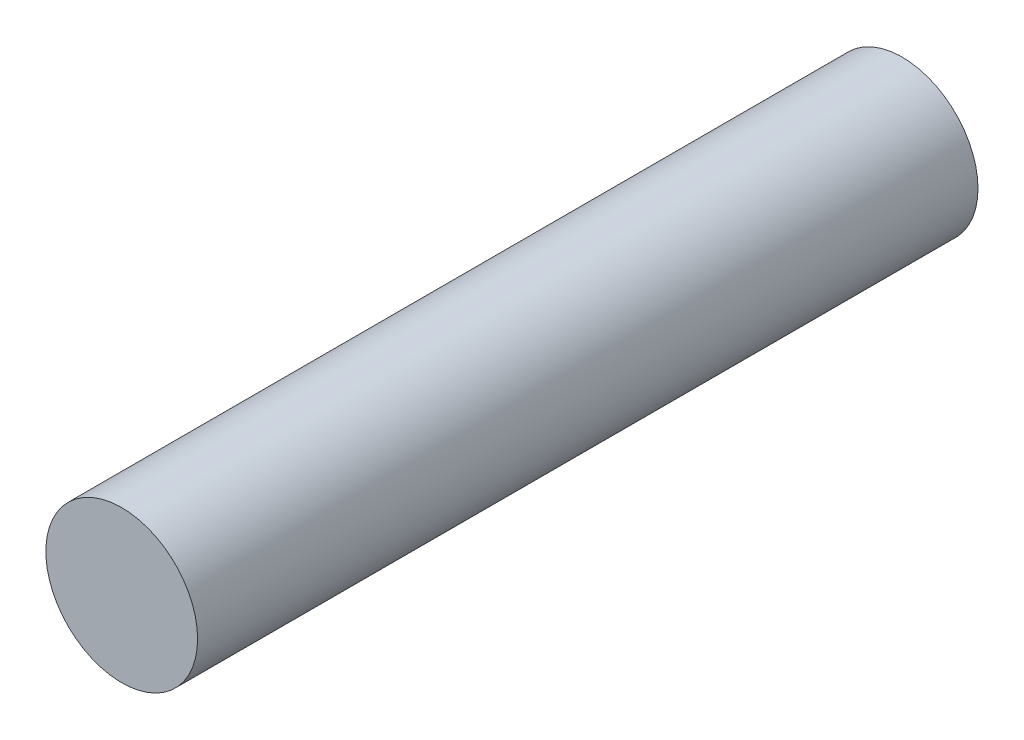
ISO-10303-21;
HEADER;
FILE_DESCRIPTION(('STEP AP214'),'2;1');
FILE_NAME('part.step','',(''),(''),'','','');
FILE_SCHEMA(('AUTOMOTIVE_DESIGN { 1 0 10303 214 1 1 1 1 }'));
ENDSEC;
DATA;
#1=APPLICATION_CONTEXT('core data for automotive mechanical design processes');
#2=APPLICATION_PROTOCOL_DEFINITION('international standard','automotive_design',2000,#1);
#3=PRODUCT_CONTEXT('',#1,'mechanical');
#4=PRODUCT('Part','Part','',(#3));
#5=PRODUCT_RELATED_PRODUCT_CATEGORY('part','',(#4));
#6=PRODUCT_DEFINITION_FORMATION('','',#4);
#7=PRODUCT_DEFINITION_CONTEXT('part definition',#1,'design');
#8=PRODUCT_DEFINITION('design','',#6,#7);
#9=PRODUCT_DEFINITION_SHAPE('','',#8);
#10=(LENGTH_UNIT() NAMED_UNIT(*) SI_UNIT(.MILLI.,.METRE.));
#11=(NAMED_UNIT(*) PLANE_ANGLE_UNIT() SI_UNIT($,.RADIAN.));
#12=(NAMED_UNIT(*) SI_UNIT($,.STERADIAN.) SOLID_ANGLE_UNIT());
#13=UNCERTAINTY_MEASURE_WITH_UNIT(LENGTH_MEASURE(1.E-05),#10,'distance_accuracy_value','');
#14=(GEOMETRIC_REPRESENTATION_CONTEXT(3) GLOBAL_UNCERTAINTY_ASSIGNED_CONTEXT((#13)) GLOBAL_UNIT_ASSIGNED_CONTEXT((#10,
#11,#12)) REPRESENTATION_CONTEXT('',''));
#15=CARTESIAN_POINT('',(0.,0.,0.));
#16=DIRECTION('',(0.,0.,1.));
#17=DIRECTION('',(1.,0.,0.));
#18=AXIS2_PLACEMENT_3D('',#15,#16,#17);
#19=CARTESIAN_POINT('',(0.,0.,0.));
#20=DIRECTION('',(0.,0.,0.999999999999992));
#21=DIRECTION('',(0.999999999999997,0.,0.));
#22=AXIS2_PLACEMENT_3D('',#19,#20,#21);
#23=PLANE('',#22);
#24=CARTESIAN_POINT('',(0.,0.,0.));
#25=DIRECTION('',(0.,0.,0.999999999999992));
#26=DIRECTION('',(0.999999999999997,0.,0.));
#27=AXIS2_PLACEMENT_3D('',#24,#25,#26);
#28=CIRCLE('',#27,1.58496);
#29=CARTESIAN_POINT('',(1.58496000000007,0.,0.));
#30=VERTEX_POINT('',#29);
#31=EDGE_CURVE('E10',#30,#30,#28,.T.);
#32=ORIENTED_EDGE('',*,*,#31,.T.);
#33=EDGE_LOOP('',(#32));
#34=FACE_BOUND('',#33,.T.);
#35=ADVANCED_FACE('F28',(#34),#23,.T.);
#36=CARTESIAN_POINT('',(0.,0.,0.));
#37=DIRECTION('',(0.,0.,0.999999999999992));
#38=DIRECTION('',(0.999999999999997,0.,0.));
#39=AXIS2_PLACEMENT_3D('',#36,#37,#38);
#40=CYLINDRICAL_SURFACE('',#39,1.58496);
#41=CARTESIAN_POINT('',(0.,1.2490009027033E-13,-16.3048904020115));
#42=DIRECTION('',(0.,0.,0.999999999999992));
#43=DIRECTION('',(0.999999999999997,0.,0.));
#44=AXIS2_PLACEMENT_3D('',#41,#42,#43);
#45=CIRCLE('',#44,1.58496);
#46=CARTESIAN_POINT('',(1.58496000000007,0.,-16.3048904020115));
#47=VERTEX_POINT('',#46);
#48=EDGE_CURVE('E34',#47,#47,#45,.T.);
#49=CARTESIAN_POINT('',(1.58496000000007,0.,-16.3048904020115));
#50=CARTESIAN_POINT('',(1.58496000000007,0.,-16.1350477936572));
#51=CARTESIAN_POINT('',(1.58496000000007,0.,-15.9652051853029));
#52=CARTESIAN_POINT('',(1.58496000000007,0.,-15.6255199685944));
#53=CARTESIAN_POINT('',(1.58496000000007,0.,-15.4556773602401));
#54=CARTESIAN_POINT('',(1.58496000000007,0.,-15.1159921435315));
#55=CARTESIAN_POINT('',(1.58496000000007,0.,-14.9461495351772));
#56=CARTESIAN_POINT('',(1.58496000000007,0.,-14.6064643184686));
#57=CARTESIAN_POINT('',(1.58496000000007,0.,-14.4366217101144));
#58=CARTESIAN_POINT('',(1.58496000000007,0.,-14.0969364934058));
#59=CARTESIAN_POINT('',(1.58496000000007,0.,-13.9270938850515));
#60=CARTESIAN_POINT('',(1.58496000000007,0.,-13.5874086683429));
#61=CARTESIAN_POINT('',(1.58496000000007,0.,-13.4175660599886));
#62=CARTESIAN_POINT('',(1.58496000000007,0.,-13.0778808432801));
#63=CARTESIAN_POINT('',(1.58496000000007,0.,-12.9080382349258));
#64=CARTESIAN_POINT('',(1.58496000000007,0.,-12.5683530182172));
#65=CARTESIAN_POINT('',(1.58496000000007,0.,-12.3985104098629));
#66=CARTESIAN_POINT('',(1.58496000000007,0.,-12.0588251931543));
#67=CARTESIAN_POINT('',(1.58496000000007,0.,-11.8889825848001));
#68=CARTESIAN_POINT('',(1.58496000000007,0.,-11.5492973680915));
#69=CARTESIAN_POINT('',(1.58496000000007,0.,-11.3794547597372));
#70=CARTESIAN_POINT('',(1.58496000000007,0.,-11.0397695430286));
#71=CARTESIAN_POINT('',(1.58496000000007,0.,-10.8699269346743));
#72=CARTESIAN_POINT('',(1.58496000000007,0.,-10.5302417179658));
#73=CARTESIAN_POINT('',(1.58496000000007,0.,-10.3603991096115));
#74=CARTESIAN_POINT('',(1.58496000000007,0.,-10.0207138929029));
#75=CARTESIAN_POINT('',(1.58496000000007,0.,-9.85087128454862));
#76=CARTESIAN_POINT('',(1.58496000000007,0.,-9.51118606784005));
#77=CARTESIAN_POINT('',(1.58496000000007,0.,-9.34134345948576));
#78=CARTESIAN_POINT('',(1.58496000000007,0.,-9.00165824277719));
#79=CARTESIAN_POINT('',(1.58496000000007,0.,-8.8318156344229));
#80=CARTESIAN_POINT('',(1.58496000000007,0.,-8.49213041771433));
#81=CARTESIAN_POINT('',(1.58496000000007,0.,-8.32228780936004));
#82=CARTESIAN_POINT('',(1.58496000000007,0.,-7.98260259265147));
#83=CARTESIAN_POINT('',(1.58496000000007,0.,-7.81275998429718));
#84=CARTESIAN_POINT('',(1.58496000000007,0.,-7.47307476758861));
#85=CARTESIAN_POINT('',(1.58496000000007,0.,-7.30323215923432));
#86=CARTESIAN_POINT('',(1.58496000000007,0.,-6.96354694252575));
#87=CARTESIAN_POINT('',(1.58496000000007,0.,-6.79370433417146));
#88=CARTESIAN_POINT('',(1.58496000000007,0.,-6.45401911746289));
#89=CARTESIAN_POINT('',(1.58496000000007,0.,-6.28417650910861));
#90=CARTESIAN_POINT('',(1.58496000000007,0.,-5.94449129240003));
#91=CARTESIAN_POINT('',(1.58496000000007,0.,-5.77464868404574));
#92=CARTESIAN_POINT('',(1.58496000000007,0.,-5.43496346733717));
#93=CARTESIAN_POINT('',(1.58496000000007,0.,-5.26512085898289));
#94=CARTESIAN_POINT('',(1.58496000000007,0.,-4.92543564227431));
#95=CARTESIAN_POINT('',(1.58496000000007,0.,-4.75559303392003));
#96=CARTESIAN_POINT('',(1.58496000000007,0.,-4.41590781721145));
#97=CARTESIAN_POINT('',(1.58496000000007,0.,-4.24606520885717));
#98=CARTESIAN_POINT('',(1.58496000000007,0.,-3.90637999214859));
#99=CARTESIAN_POINT('',(1.58496000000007,0.,-3.73653738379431));
#100=CARTESIAN_POINT('',(1.58496000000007,0.,-3.39685216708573));
#101=CARTESIAN_POINT('',(1.58496000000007,0.,-3.22700955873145));
#102=CARTESIAN_POINT('',(1.58496000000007,0.,-2.88732434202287));
#103=CARTESIAN_POINT('',(1.58496000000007,0.,-2.71748173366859));
#104=CARTESIAN_POINT('',(1.58496000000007,0.,-2.37779651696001));
#105=CARTESIAN_POINT('',(1.58496000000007,0.,-2.20795390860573));
#106=CARTESIAN_POINT('',(1.58496000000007,0.,-1.86826869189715));
#107=CARTESIAN_POINT('',(1.58496000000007,0.,-1.69842608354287));
#108=CARTESIAN_POINT('',(1.58496000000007,0.,-1.35874086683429));
#109=CARTESIAN_POINT('',(1.58496000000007,0.,-1.18889825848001));
#110=CARTESIAN_POINT('',(1.58496000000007,0.,-0.849213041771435));
#111=CARTESIAN_POINT('',(1.58496000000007,0.,-0.679370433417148));
#112=CARTESIAN_POINT('',(1.58496000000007,0.,-0.339685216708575));
#113=CARTESIAN_POINT('',(1.58496000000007,0.,-0.169842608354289));
#114=CARTESIAN_POINT('',(1.58496000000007,0.,0.));
#115=B_SPLINE_CURVE_WITH_KNOTS('',3,(#49,#50,#51,#52,#53,#54,#55,#56,#57,#58,#59,#60,#61,#62,
#63,#64,#65,#66,#67,#68,#69,#70,#71,#72,#73,#74,#75,#76,#77,#78,#79,#80,#81,#82,#83,#84,#85,#86,
#87,#88,#89,#90,#91,#92,#93,#94,#95,#96,#97,#98,#99,#100,#101,#102,#103,#104,#105,#106,#107,
#108,#109,#110,#111,#112,#113,#114),.UNSPECIFIED.,.F.,.F.,(4,2,2,2,2,2,2,2,2,2,2,2,2,2,2,2,2,2,
2,2,2,2,2,2,2,2,2,2,2,2,2,2,4),(0.,0.509527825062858,1.01905565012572,1.52858347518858,
2.03811130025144,2.5476391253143,3.05716695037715,3.56669477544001,4.07622260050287,
4.58575042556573,5.0952782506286,5.60480607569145,6.11433390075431,6.62386172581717,
7.13338955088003,7.64291737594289,8.15244520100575,8.66197302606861,9.17150085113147,
9.68102867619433,10.1905565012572,10.7000843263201,11.2096121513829,11.7191399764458,
12.2286678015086,12.7381956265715,13.2477234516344,13.7572512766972,14.2667791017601,
14.7763069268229,15.2858347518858,15.7953625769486,16.3048904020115),.UNSPECIFIED.);
#116=EDGE_CURVE('BSEAM54',#47,#30,#115,.T.);
#117=ORIENTED_EDGE('',*,*,#48,.T.);
#118=ORIENTED_EDGE('',*,*,#31,.F.);
#119=ORIENTED_EDGE('',*,*,#116,.T.);
#120=ORIENTED_EDGE('',*,*,#116,.F.);
#121=EDGE_LOOP('',(#117,#119,#118,#120));
#122=FACE_BOUND('',#121,.T.);
#123=ADVANCED_FACE('F54',(#122),#40,.T.);
#124=CARTESIAN_POINT('',(0.,1.2490009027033E-13,-16.3048904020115));
#125=DIRECTION('',(0.,0.,0.999999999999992));
#126=DIRECTION('',(0.999999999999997,0.,0.));
#127=AXIS2_PLACEMENT_3D('',#124,#125,#126);
#128=CONICAL_SURFACE('',#127,1.58496,1.36135681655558);
#129=CARTESIAN_POINT('',(0.,1.2490009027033E-13,-16.5607999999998));
#130=DIRECTION('',(0.,0.,0.999999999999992));
#131=DIRECTION('',(0.999999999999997,0.,0.));
#132=AXIS2_PLACEMENT_3D('',#129,#130,#131);
#133=CIRCLE('',#132,0.381);
#134=CARTESIAN_POINT('',(0.381000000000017,1.25553088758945E-13,-16.5607999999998));
#135=VERTEX_POINT('',#134);
#136=EDGE_CURVE('E38',#135,#135,#133,.T.);
#137=CARTESIAN_POINT('',(0.381000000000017,1.25553088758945E-13,-16.5607999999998));
#138=CARTESIAN_POINT('',(0.393541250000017,1.25574583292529E-13,-16.5581342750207));
#139=CARTESIAN_POINT('',(0.406082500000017,1.25596077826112E-13,-16.5554685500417));
#140=CARTESIAN_POINT('',(0.431165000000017,1.25639066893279E-13,-16.5501371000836));
#141=CARTESIAN_POINT('',(0.443706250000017,1.25660561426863E-13,-16.5474713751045));
#142=CARTESIAN_POINT('',(0.468788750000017,1.2570355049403E-13,-16.5421399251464));
#143=CARTESIAN_POINT('',(0.481330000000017,1.25725045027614E-13,-16.5394742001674));
#144=CARTESIAN_POINT('',(0.506412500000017,1.25768034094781E-13,-16.5341427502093));
#145=CARTESIAN_POINT('',(0.518953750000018,1.25789528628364E-13,-16.5314770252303));
#146=CARTESIAN_POINT('',(0.544036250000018,1.25832517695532E-13,-16.5261455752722));
#147=CARTESIAN_POINT('',(0.556577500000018,1.25854012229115E-13,-16.5234798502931));
#148=CARTESIAN_POINT('',(0.581660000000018,1.25897001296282E-13,-16.518148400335));
#149=CARTESIAN_POINT('',(0.594201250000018,1.25918495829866E-13,-16.515482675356));
#150=CARTESIAN_POINT('',(0.619283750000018,1.25961484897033E-13,-16.5101512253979));
#151=CARTESIAN_POINT('',(0.631825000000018,1.25982979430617E-13,-16.5074855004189));
#152=CARTESIAN_POINT('',(0.656907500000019,1.26025968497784E-13,-16.5021540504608));
#153=CARTESIAN_POINT('',(0.669448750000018,1.26047463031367E-13,-16.4994883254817));
#154=CARTESIAN_POINT('',(0.694531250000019,1.26090452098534E-13,-16.4941568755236));
#155=CARTESIAN_POINT('',(0.707072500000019,1.26111946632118E-13,-16.4914911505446));
#156=CARTESIAN_POINT('',(0.732155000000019,1.26154935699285E-13,-16.4861597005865));
#157=CARTESIAN_POINT('',(0.744696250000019,1.26176430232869E-13,-16.4834939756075));
#158=CARTESIAN_POINT('',(0.769778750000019,1.26219419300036E-13,-16.4781625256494));
#159=CARTESIAN_POINT('',(0.782320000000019,1.2624091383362E-13,-16.4754968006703));
#160=CARTESIAN_POINT('',(0.807402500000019,1.26283902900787E-13,-16.4701653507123));
#161=CARTESIAN_POINT('',(0.81994375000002,1.2630539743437E-13,-16.4674996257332));
#162=CARTESIAN_POINT('',(0.84502625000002,1.26348386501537E-13,-16.4621681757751));
#163=CARTESIAN_POINT('',(0.85756750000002,1.26369881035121E-13,-16.4595024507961));
#164=CARTESIAN_POINT('',(0.88265000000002,1.26412870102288E-13,-16.454171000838));
#165=CARTESIAN_POINT('',(0.89519125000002,1.26434364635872E-13,-16.4515052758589));
#166=CARTESIAN_POINT('',(0.92027375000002,1.26477353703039E-13,-16.4461738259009));
#167=CARTESIAN_POINT('',(0.93281500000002,1.26498848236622E-13,-16.4435081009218));
#168=CARTESIAN_POINT('',(0.95789750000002,1.2654183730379E-13,-16.4381766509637));
#169=CARTESIAN_POINT('',(0.97043875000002,1.26563331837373E-13,-16.4355109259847));
#170=CARTESIAN_POINT('',(0.99552125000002,1.2660632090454E-13,-16.4301794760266));
#171=CARTESIAN_POINT('',(1.00806250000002,1.26627815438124E-13,-16.4275137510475));
#172=CARTESIAN_POINT('',(1.03314500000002,1.26670804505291E-13,-16.4221823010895));
#173=CARTESIAN_POINT('',(1.04568625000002,1.26692299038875E-13,-16.4195165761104));
#174=CARTESIAN_POINT('',(1.07076875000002,1.26735288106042E-13,-16.4141851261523));
#175=CARTESIAN_POINT('',(1.08331000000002,1.26756782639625E-13,-16.4115194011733));
#176=CARTESIAN_POINT('',(1.10839250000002,1.26799771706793E-13,-16.4061879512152));
#177=CARTESIAN_POINT('',(1.12093375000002,1.26821266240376E-13,-16.4035222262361));
#178=CARTESIAN_POINT('',(1.14601625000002,1.26864255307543E-13,-16.3981907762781));
#179=CARTESIAN_POINT('',(1.15855750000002,1.26885749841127E-13,-16.395525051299));
#180=CARTESIAN_POINT('',(1.18364000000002,1.26928738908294E-13,-16.3901936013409));
#181=CARTESIAN_POINT('',(1.19618125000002,1.26950233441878E-13,-16.3875278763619));
#182=CARTESIAN_POINT('',(1.22126375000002,1.26993222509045E-13,-16.3821964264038));
#183=CARTESIAN_POINT('',(1.23380500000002,1.27014717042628E-13,-16.3795307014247));
#184=CARTESIAN_POINT('',(1.25888750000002,1.27057706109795E-13,-16.3741992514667));
#185=CARTESIAN_POINT('',(1.27142875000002,1.27079200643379E-13,-16.3715335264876));
#186=CARTESIAN_POINT('',(1.29651125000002,1.27122189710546E-13,-16.3662020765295));
#187=CARTESIAN_POINT('',(1.30905250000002,1.2714368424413E-13,-16.3635363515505));
#188=CARTESIAN_POINT('',(1.33413500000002,1.27186673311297E-13,-16.3582049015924));
#189=CARTESIAN_POINT('',(1.34667625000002,1.27208167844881E-13,-16.3555391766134));
#190=CARTESIAN_POINT('',(1.37175875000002,1.27251156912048E-13,-16.3502077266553));
#191=CARTESIAN_POINT('',(1.38430000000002,1.27272651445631E-13,-16.3475420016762));
#192=CARTESIAN_POINT('',(1.40938250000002,1.27315640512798E-13,-16.3422105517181));
#193=CARTESIAN_POINT('',(1.42192375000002,1.27337135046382E-13,-16.3395448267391));
#194=CARTESIAN_POINT('',(1.44700625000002,1.27380124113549E-13,-16.334213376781));
#195=CARTESIAN_POINT('',(1.45954750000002,1.27401618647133E-13,-16.331547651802));
#196=CARTESIAN_POINT('',(1.48463000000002,1.274446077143E-13,-16.3262162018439));
#197=CARTESIAN_POINT('',(1.49717125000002,1.27466102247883E-13,-16.3235504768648));
#198=CARTESIAN_POINT('',(1.52225375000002,1.27509091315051E-13,-16.3182190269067));
#199=CARTESIAN_POINT('',(1.53479500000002,1.27530585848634E-13,-16.3155533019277));
#200=CARTESIAN_POINT('',(1.55987750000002,1.27573574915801E-13,-16.3102218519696));
#201=CARTESIAN_POINT('',(1.57241875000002,1.27595069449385E-13,-16.3075561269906));
#202=CARTESIAN_POINT('',(1.58496000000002,1.27616563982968E-13,-16.3048904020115));
#203=B_SPLINE_CURVE_WITH_KNOTS('',3,(#137,#138,#139,#140,#141,#142,#143,#144,#145,#146,#147,
#148,#149,#150,#151,#152,#153,#154,#155,#156,#157,#158,#159,#160,#161,#162,#163,#164,#165,#166,
#167,#168,#169,#170,#171,#172,#173,#174,#175,#176,#177,#178,#179,#180,#181,#182,#183,#184,#185,
#186,#187,#188,#189,#190,#191,#192,#193,#194,#195,#196,#197,#198,#199,#200,#201,#202),
.UNSPECIFIED.,.F.,.F.,(4,2,2,2,2,2,2,2,2,2,2,2,2,2,2,2,2,2,2,2,2,2,2,2,2,2,2,2,2,2,2,2,4),(0.,
0.0384642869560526,0.0769285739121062,0.11539286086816,0.153857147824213,0.192321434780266,
0.23078572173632,0.269250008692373,0.307714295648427,0.34617858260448,0.384642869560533,
0.423107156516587,0.46157144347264,0.500035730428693,0.538500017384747,0.5769643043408,
0.615428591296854,0.653892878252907,0.69235716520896,0.730821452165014,0.769285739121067,
0.80775002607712,0.846214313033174,0.884678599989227,0.923142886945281,0.961607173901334,
1.00007146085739,1.03853574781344,1.07700003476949,1.11546432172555,1.1539286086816,
1.19239289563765,1.23085718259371),.UNSPECIFIED.);
#204=EDGE_CURVE('BSEAM45',#135,#47,#203,.T.);
#205=ORIENTED_EDGE('',*,*,#136,.T.);
#206=ORIENTED_EDGE('',*,*,#48,.F.);
#207=ORIENTED_EDGE('',*,*,#204,.T.);
#208=ORIENTED_EDGE('',*,*,#204,.F.);
#209=EDGE_LOOP('',(#205,#207,#206,#208));
#210=FACE_BOUND('',#209,.T.);
#211=ADVANCED_FACE('F45',(#210),#128,.T.);
#212=CARTESIAN_POINT('',(0.,1.2490009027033E-13,-16.5607999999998));
#213=DIRECTION('',(0.,0.,-0.999999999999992));
#214=DIRECTION('',(-0.999999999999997,0.,0.));
#215=AXIS2_PLACEMENT_3D('',#212,#213,#214);
#216=PLANE('',#215);
#217=ORIENTED_EDGE('',*,*,#136,.F.);
#218=EDGE_LOOP('',(#217));
#219=FACE_BOUND('',#218,.T.);
#220=ADVANCED_FACE('F48',(#219),#216,.T.);
#221=CLOSED_SHELL('',(#35,#123,#211,#220));
#222=MANIFOLD_SOLID_BREP('B2',#221);
#223=ADVANCED_BREP_SHAPE_REPRESENTATION('',(#18,#222),#14);
#224=SHAPE_DEFINITION_REPRESENTATION(#9,#223);
ENDSEC;
END-ISO-10303-21;
